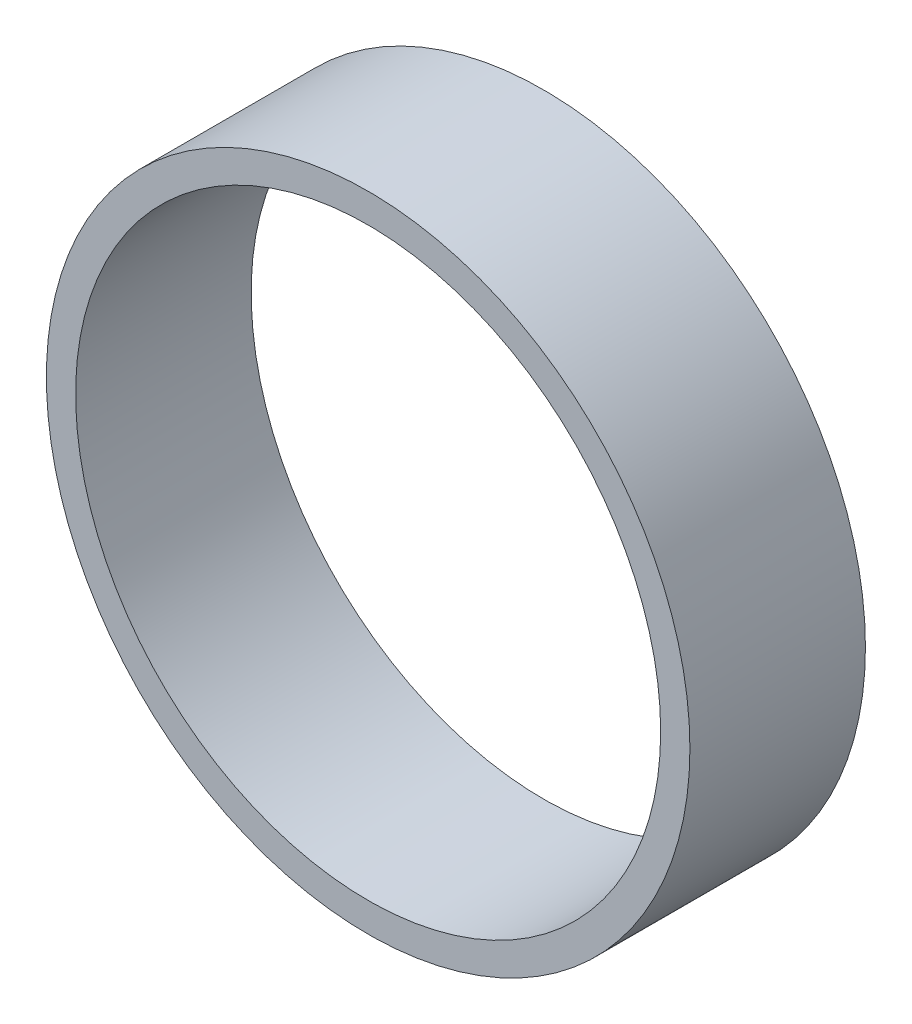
ISO-10303-21;
HEADER;
FILE_DESCRIPTION(('STEP AP214'),'2;1');
FILE_NAME('part.step','',(''),(''),'','','');
FILE_SCHEMA(('AUTOMOTIVE_DESIGN { 1 0 10303 214 1 1 1 1 }'));
ENDSEC;
DATA;
#1=APPLICATION_CONTEXT('core data for automotive mechanical design processes');
#2=APPLICATION_PROTOCOL_DEFINITION('international standard','automotive_design',2000,#1);
#3=PRODUCT_CONTEXT('',#1,'mechanical');
#4=PRODUCT('Part','Part','',(#3));
#5=PRODUCT_RELATED_PRODUCT_CATEGORY('part','',(#4));
#6=PRODUCT_DEFINITION_FORMATION('','',#4);
#7=PRODUCT_DEFINITION_CONTEXT('part definition',#1,'design');
#8=PRODUCT_DEFINITION('design','',#6,#7);
#9=PRODUCT_DEFINITION_SHAPE('','',#8);
#10=(LENGTH_UNIT() NAMED_UNIT(*) SI_UNIT(.MILLI.,.METRE.));
#11=(NAMED_UNIT(*) PLANE_ANGLE_UNIT() SI_UNIT($,.RADIAN.));
#12=(NAMED_UNIT(*) SI_UNIT($,.STERADIAN.) SOLID_ANGLE_UNIT());
#13=UNCERTAINTY_MEASURE_WITH_UNIT(LENGTH_MEASURE(1.E-05),#10,'distance_accuracy_value','');
#14=(GEOMETRIC_REPRESENTATION_CONTEXT(3) GLOBAL_UNCERTAINTY_ASSIGNED_CONTEXT((#13)) GLOBAL_UNIT_ASSIGNED_CONTEXT((#10,
#11,#12)) REPRESENTATION_CONTEXT('',''));
#15=CARTESIAN_POINT('',(0.,0.,0.));
#16=DIRECTION('',(0.,0.,1.));
#17=DIRECTION('',(1.,0.,0.));
#18=AXIS2_PLACEMENT_3D('',#15,#16,#17);
#19=CARTESIAN_POINT('',(0.,0.,15.));
#20=DIRECTION('',(0.,0.,1.));
#21=DIRECTION('',(1.,0.,0.));
#22=AXIS2_PLACEMENT_3D('',#19,#20,#21);
#23=PLANE('',#22);
#24=CARTESIAN_POINT('',(0.,0.,15.));
#25=DIRECTION('',(0.,0.,1.));
#26=DIRECTION('',(1.,0.,0.));
#27=AXIS2_PLACEMENT_3D('',#24,#25,#26);
#28=CIRCLE('',#27,27.5);
#29=CARTESIAN_POINT('',(27.5,0.,15.));
#30=VERTEX_POINT('',#29);
#31=EDGE_CURVE('E10',#30,#30,#28,.T.);
#32=ORIENTED_EDGE('',*,*,#31,.T.);
#33=EDGE_LOOP('',(#32));
#34=FACE_BOUND('',#33,.T.);
#35=CARTESIAN_POINT('',(0.,0.,15.));
#36=DIRECTION('',(0.,0.,1.));
#37=DIRECTION('',(1.,0.,0.));
#38=AXIS2_PLACEMENT_3D('',#35,#36,#37);
#39=CIRCLE('',#38,25.);
#40=CARTESIAN_POINT('',(25.,0.,15.));
#41=VERTEX_POINT('',#40);
#42=EDGE_CURVE('E40',#41,#41,#39,.T.);
#43=ORIENTED_EDGE('',*,*,#42,.F.);
#44=EDGE_LOOP('',(#43));
#45=FACE_BOUND('',#44,.T.);
#46=ADVANCED_FACE('F29',(#34,#45),#23,.T.);
#47=CARTESIAN_POINT('',(0.,0.,0.));
#48=DIRECTION('',(0.,0.,1.));
#49=DIRECTION('',(1.,0.,0.));
#50=AXIS2_PLACEMENT_3D('',#47,#48,#49);
#51=PLANE('',#50);
#52=CARTESIAN_POINT('',(0.,0.,0.));
#53=DIRECTION('',(0.,0.,1.));
#54=DIRECTION('',(1.,0.,0.));
#55=AXIS2_PLACEMENT_3D('',#52,#53,#54);
#56=CIRCLE('',#55,27.5);
#57=CARTESIAN_POINT('',(27.5,0.,0.));
#58=VERTEX_POINT('',#57);
#59=EDGE_CURVE('E33',#58,#58,#56,.T.);
#60=ORIENTED_EDGE('',*,*,#59,.F.);
#61=EDGE_LOOP('',(#60));
#62=FACE_BOUND('',#61,.T.);
#63=CARTESIAN_POINT('',(0.,0.,0.));
#64=DIRECTION('',(0.,0.,1.));
#65=DIRECTION('',(1.,0.,0.));
#66=AXIS2_PLACEMENT_3D('',#63,#64,#65);
#67=CIRCLE('',#66,25.);
#68=CARTESIAN_POINT('',(25.,0.,0.));
#69=VERTEX_POINT('',#68);
#70=EDGE_CURVE('E42',#69,#69,#67,.T.);
#71=ORIENTED_EDGE('',*,*,#70,.T.);
#72=EDGE_LOOP('',(#71));
#73=FACE_BOUND('',#72,.T.);
#74=ADVANCED_FACE('F52',(#62,#73),#51,.F.);
#75=CARTESIAN_POINT('',(0.,0.,15.));
#76=DIRECTION('',(0.,0.,-1.));
#77=DIRECTION('',(-1.,0.,0.));
#78=AXIS2_PLACEMENT_3D('',#75,#76,#77);
#79=CYLINDRICAL_SURFACE('',#78,27.5);
#80=ORIENTED_EDGE('',*,*,#31,.F.);
#81=EDGE_LOOP('',(#80));
#82=FACE_BOUND('',#81,.T.);
#83=ORIENTED_EDGE('',*,*,#59,.T.);
#84=EDGE_LOOP('',(#83));
#85=FACE_BOUND('',#84,.T.);
#86=ADVANCED_FACE('F31',(#82,#85),#79,.T.);
#87=CARTESIAN_POINT('',(0.,0.,15.));
#88=DIRECTION('',(0.,0.,-1.));
#89=DIRECTION('',(-1.,0.,0.));
#90=AXIS2_PLACEMENT_3D('',#87,#88,#89);
#91=CYLINDRICAL_SURFACE('',#90,25.);
#92=ORIENTED_EDGE('',*,*,#42,.T.);
#93=EDGE_LOOP('',(#92));
#94=FACE_BOUND('',#93,.T.);
#95=ORIENTED_EDGE('',*,*,#70,.F.);
#96=EDGE_LOOP('',(#95));
#97=FACE_BOUND('',#96,.T.);
#98=ADVANCED_FACE('F48',(#94,#97),#91,.F.);
#99=CLOSED_SHELL('',(#46,#74,#86,#98));
#100=MANIFOLD_SOLID_BREP('B2',#99);
#101=ADVANCED_BREP_SHAPE_REPRESENTATION('',(#18,#100),#14);
#102=SHAPE_DEFINITION_REPRESENTATION(#9,#101);
ENDSEC;
END-ISO-10303-21;
